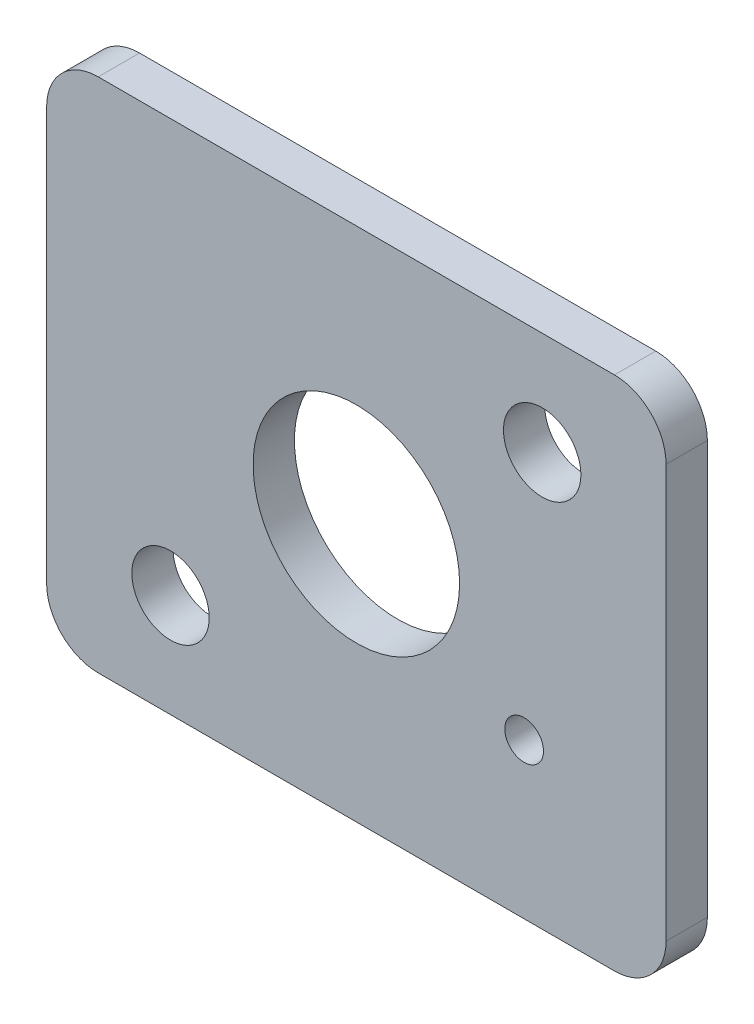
from build123d import *

# Parameters (mm, degrees)
SKETCH_1_W          = 12
SKETCH_1_H          = 10
EXTRUDE_1_DEPTH     = 0.8
CUT_EXTRUDE_1_REACH = 9.851
SKETCH_2_R          = 2
SKETCH_2_R_2        = 0.75
SKETCH_2_R_3        = 0.375
FILLET_1_R          = 1


with BuildPart() as part:
    # Sketch 1 → Extrude 1 (new body)
    with BuildSketch(Plane.XY):
        Rectangle(SKETCH_1_W, SKETCH_1_H)
    extrude(amount=EXTRUDE_1_DEPTH)

    # Sketch 2 → Cut-Extrude 1 (cut, up to next)
    with BuildSketch(Plane.XY.offset(0.8), mode=Mode.PRIVATE) as cut_extrude_1_sk1:
        Circle(SKETCH_2_R)
    cut_extrude_1_tool1 = extrude(cut_extrude_1_sk1.sketch, amount=-CUT_EXTRUDE_1_REACH, mode=Mode.PRIVATE) & part.part
    # Sketch 2 → Cut-Extrude 1 (cut, up to next)
    with BuildSketch(Plane.XY.offset(0.8), mode=Mode.PRIVATE) as cut_extrude_1_sk2:
        with Locations((-3.6, -3)):
            Circle(SKETCH_2_R_2)
    cut_extrude_1_tool2 = extrude(cut_extrude_1_sk2.sketch, amount=-CUT_EXTRUDE_1_REACH, mode=Mode.PRIVATE) & part.part
    # Sketch 2 → Cut-Extrude 1 (cut, up to next)
    with BuildSketch(Plane.XY.offset(0.8), mode=Mode.PRIVATE) as cut_extrude_1_sk3:
        with Locations((3.6, 3)):
            Circle(SKETCH_2_R_2)
    cut_extrude_1_tool3 = extrude(cut_extrude_1_sk3.sketch, amount=-CUT_EXTRUDE_1_REACH, mode=Mode.PRIVATE) & part.part
    # Sketch 2 → Cut-Extrude 1 (cut, up to next)
    with BuildSketch(Plane.XY.offset(0.8), mode=Mode.PRIVATE) as cut_extrude_1_sk4:
        with Locations((3.25, -2)):
            Circle(SKETCH_2_R_3)
    cut_extrude_1_tool4 = extrude(cut_extrude_1_sk4.sketch, amount=-CUT_EXTRUDE_1_REACH, mode=Mode.PRIVATE) & part.part
    add(cut_extrude_1_tool1.solids().sort_by_distance((0, 0, 0.8))[0], mode=Mode.SUBTRACT)
    add(cut_extrude_1_tool2.solids().sort_by_distance((-3.6, -3, 0.8))[0], mode=Mode.SUBTRACT)
    add(cut_extrude_1_tool3.solids().sort_by_distance((3.6, 3, 0.8))[0], mode=Mode.SUBTRACT)
    add(cut_extrude_1_tool4.solids().sort_by_distance((3.25, -2, 0.8))[0], mode=Mode.SUBTRACT)

    # Fillet 1
    fillet_1_edges = [part.edges().sort_by_distance(p)[0] for p in [
        (6, -5, 0.4),
        (-6, -5, 0.4),
        (-6, 5, 0.4),
        (6, 5, 0.4),
    ]]
    fillet(fillet_1_edges, radius=FILLET_1_R)


solid = part.part
